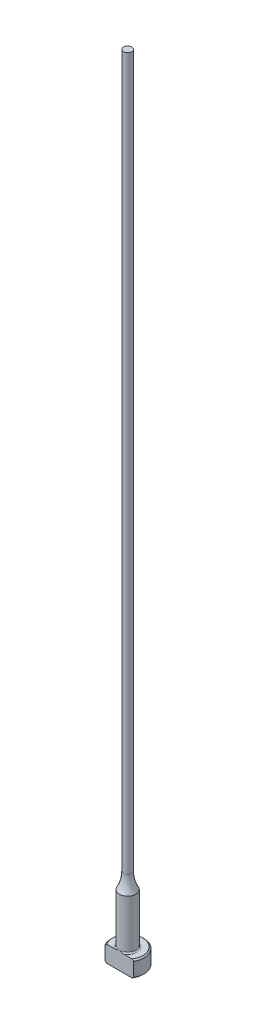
from build123d import *

# Parameters (mm, degrees)
CHAMFER1_SIZE      = 0.254
FILLET1_R          = 0.254
CUT_EXTRUDE1_DEPTH = 153.466131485


with BuildPart() as part:
    # Sketch1 → Revolve1 (revolve)
    with BuildSketch(Plane.XY, mode=Mode.PRIVATE) as revolve1_sk:
        with BuildLine():
            Line((0, 0), (-3.175, 0))
            Line((-3.175, 0), (-3.175, 3.175))
            Line((-3.175, 3.175), (-1.5875, 3.175))
            Line((-1.5875, 3.175), (-1.5875, 12.7))
            ThreePointArc((-1.5875, 12.7), (-0.995388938, 14.186680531), (-0.79375, 15.774180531))
            Line((-0.79375, 15.774180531), (-0.79375, 152.4))
            Line((-0.79375, 152.4), (0, 152.4))
            Line((0, 152.4), (0, 0))
        make_face()
    revolve(revolve1_sk.sketch.rotate(Axis((0, 259.958771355, 0), (0, -1, 0)), 270), axis=Axis((0, 259.958771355, 0), (0, -1, 0)))

    # Chamfer1
    chamfer1_edges = [part.edges().sort_by_distance(p)[0] for p in [
        (0, 0, -3.175),
        (0, 3.175, -3.175),
    ]]
    chamfer(chamfer1_edges, length=CHAMFER1_SIZE)

    # Fillet1
    fillet1_edges = [part.edges().sort_by_distance(p)[0] for p in [
        (0, 3.175, -1.5875),
    ]]
    fillet(fillet1_edges, radius=FILLET1_R)

    # Sketch2 → Cut-Extrude1 (cut, through all)
    with BuildSketch(Plane.XZ):
        with BuildLine():
            Line((-2.749630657, 1.5875), (2.749630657, 1.5875))
            ThreePointArc((2.749630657, 1.5875), (0, 3.175), (-2.749630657, 1.5875))
        make_face()
    extrude(amount=-CUT_EXTRUDE1_DEPTH, mode=Mode.SUBTRACT)


solid = part.part
